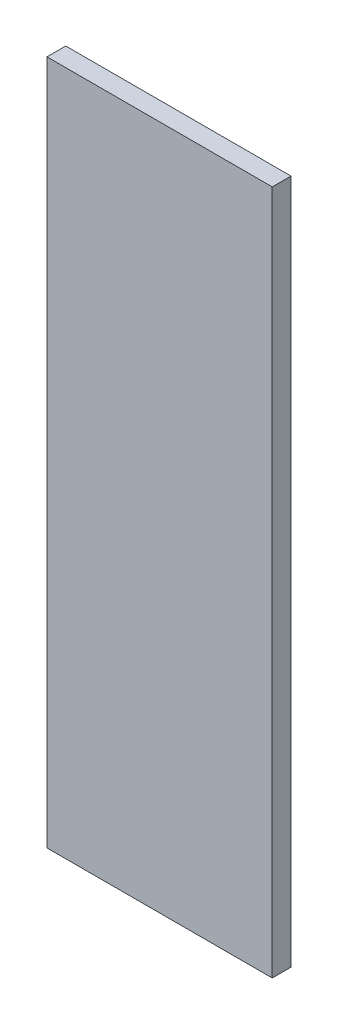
from build123d import *

# Parameters (mm, degrees)
SKETCH1_W  = 12
SKETCH1_H  = 36.5
TAPE_DEPTH = 1


with BuildPart() as part:
    # Sketch1 → Tape (new body)
    with BuildSketch(Plane.XY):
        Rectangle(SKETCH1_W, SKETCH1_H)
    extrude(amount=TAPE_DEPTH)


solid = part.part
